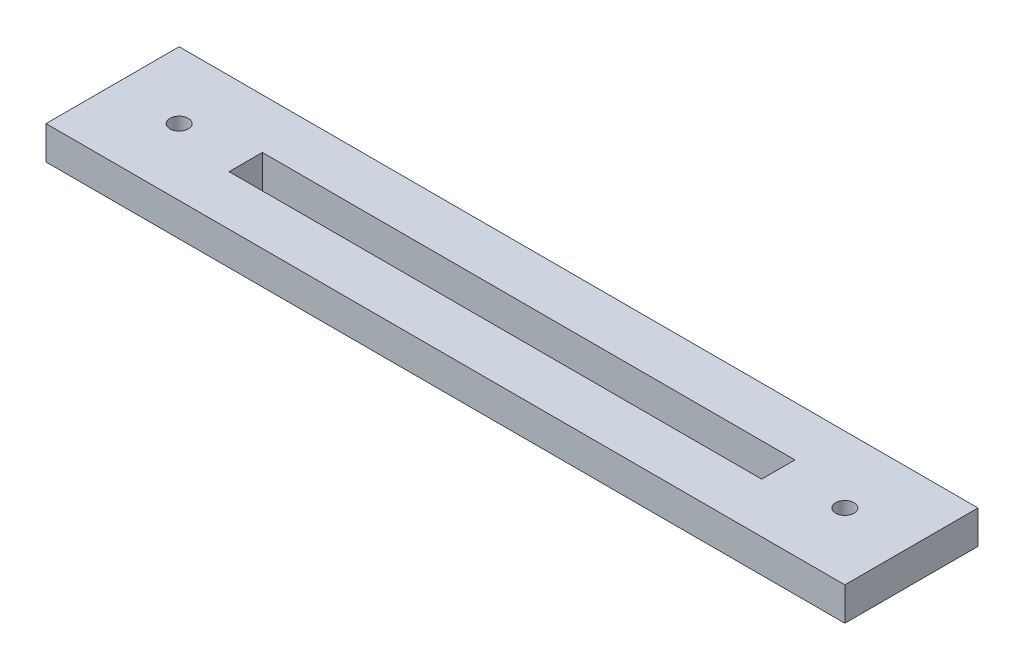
from build123d import *

# Parameters (mm, degrees)
SKETCH1_W           = 152.4
SKETCH1_H           = 25.4
SKETCH1_R           = 1.75
SKETCH1_W_2         = 101.6
SKETCH1_H_2         = 6.35
BOSS_EXTRUDE1_DEPTH = 6.35


with BuildPart() as part:
    # Sketch1 → Boss-Extrude1 (new body)
    with BuildSketch(Plane(origin=(0, 0, 0), x_dir=(1, 0, 0), z_dir=(0, 1, 0))):
        Rectangle(SKETCH1_W, SKETCH1_H)
        with Locations(Location((63.5, 0, 0), (0, 0, 270))):
            Circle(SKETCH1_R, mode=Mode.SUBTRACT)
        with Locations(Location((-63.5, 0, 0), (0, 0, 90))):
            Circle(SKETCH1_R, mode=Mode.SUBTRACT)
        Rectangle(SKETCH1_W_2, SKETCH1_H_2, mode=Mode.SUBTRACT)
    extrude(amount=BOSS_EXTRUDE1_DEPTH)


solid = part.part
